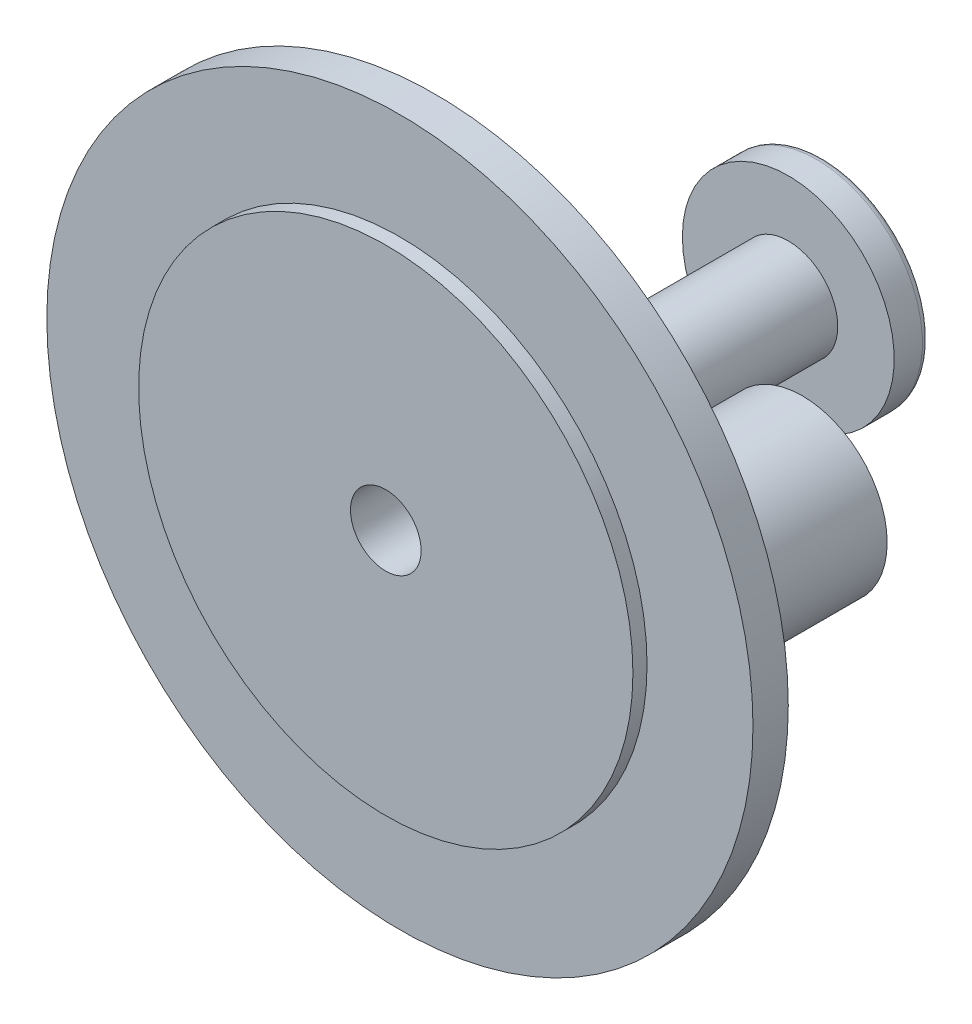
from build123d import *
from build123d.topology import SkipClean

# Parameters (mm, degrees)
SKIZZE1_R                       = 50
LINEAR_AUSTRAGEN1_DEPTH         = 5
SKIZZE2_R                       = 35
LINEAR_AUSTRAGEN2_DEPTH         = 2
SKIZZE3_R                       = 7
SKIZZE3_R_2                     = 5
LINEAR_AUSTRAGEN3_DEPTH         = 50
SKIZZE4_R                       = 5
SCHNITT_LINEAR_AUSTRAGEN2_DEPTH = 91.824005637
SKIZZE5_R                       = 15
SKIZZE5_R_2                     = 5
LINEAR_AUSTRAGEN4_DEPTH         = 5
VERRUNDUNG1_R                   = 1
SKIZZE6_R                       = 12
SKIZZE6_R_2                     = 10
LINEAR_AUSTRAGEN5_DEPTH         = 25
SKIZZE7_R                       = 12
LINEAR_AUSTRAGEN6_DEPTH         = 2


with BuildPart() as part:
    # Skizze1 → Linear austragen1 (new body)
    with BuildSketch(Plane.XY):
        Circle(SKIZZE1_R)
    extrude(amount=LINEAR_AUSTRAGEN1_DEPTH)

    # Skizze2 → Linear austragen2 (add)
    with BuildSketch(Plane.XY.offset(5)):
        Circle(SKIZZE2_R)
    extrude(amount=LINEAR_AUSTRAGEN2_DEPTH)

    # Skizze3 → Linear austragen3 (add)
    with BuildSketch(Plane(origin=(0, 0, 0), x_dir=(-1, 0, 0), z_dir=(0, 0, -1))):
        with Locations(Location((0, 0, 0), (0, 0, 180))):
            Circle(SKIZZE3_R)
        Circle(SKIZZE3_R_2, mode=Mode.SUBTRACT)
    extrude(amount=LINEAR_AUSTRAGEN3_DEPTH)

    # Skizze4 → Schnitt-Linear austragen2 (cut, through all)
    with SkipClean():  # the faces are left unmerged after this step: merging them gives an invalid solid
        with BuildSketch(Plane.XY.offset(7)):
            Circle(SKIZZE4_R)
        extrude(amount=-SCHNITT_LINEAR_AUSTRAGEN2_DEPTH, mode=Mode.SUBTRACT)

    # Skizze5 → Linear austragen4 (add)
    with BuildSketch(Plane(origin=(0, 0, -50), x_dir=(-1, 0, 0), z_dir=(0, 0, -1))):
        Circle(SKIZZE5_R)
        with Locations(Location((0, 0, 0), (0, 0, 180))):
            Circle(SKIZZE5_R_2, mode=Mode.SUBTRACT)
    extrude(amount=LINEAR_AUSTRAGEN4_DEPTH)

    # Verrundung1
    verrundung1_edges = [part.edges().sort_by_distance(p)[0] for p in [
        (15, 0, -55),
    ]]
    fillet(verrundung1_edges, radius=VERRUNDUNG1_R)

    # Skizze6 → Linear austragen5 (add)
    with BuildSketch(Plane(origin=(0, 0, 0), x_dir=(-1, 0, 0), z_dir=(0, 0, -1))):
        with Locations(Location((-25, 0, 0), (0, 0, 180))):
            Circle(SKIZZE6_R)
        with Locations((-25, 0)):
            Circle(SKIZZE6_R_2, mode=Mode.SUBTRACT)
    extrude(amount=LINEAR_AUSTRAGEN5_DEPTH)

    # Skizze7 → Linear austragen6 (add)
    with BuildSketch(Plane(origin=(0, 0, -25), x_dir=(-1, 0, 0), z_dir=(0, 0, -1))):
        with Locations(Location((-25, 0, 0), (0, 0, 180))):
            Circle(SKIZZE7_R)
    extrude(amount=LINEAR_AUSTRAGEN6_DEPTH)


solid = part.part
